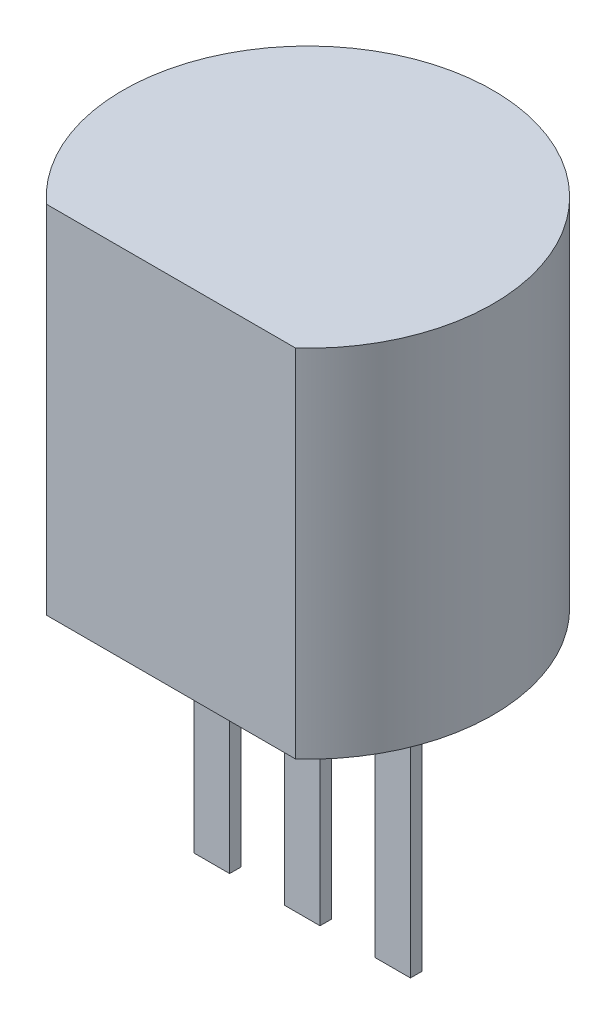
from build123d import *

# Parameters (mm, degrees)
EXTRUDE_START   = 1.5
EXTRUDE_1_DEPTH = 5
SKETCH_2_W      = 0.5
SKETCH_2_H      = 0.16
EXTRUDE_2_DEPTH = 3.7


with BuildPart() as part:
    # Sketch 1 → Extrude 1 (new body)
    with BuildSketch(Plane(origin=(0, 0, 0), x_dir=(1, 0, 0), z_dir=(0, 1, 0)).offset(EXTRUDE_START)):
        with BuildLine():
            Line((-1.75, -1.922888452), (1.75, -1.922888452))
            ThreePointArc((1.75, -1.922888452), (0, 2.6), (-1.75, -1.922888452))
        make_face()
    extrude(amount=EXTRUDE_1_DEPTH)

    # Sketch 2 → Extrude 2 (add)
    with BuildSketch(Plane.XZ.offset(-1.5)):
        Rectangle(SKETCH_2_W, SKETCH_2_H)
        with Locations((-1.27, 0)):
            Rectangle(SKETCH_2_W, SKETCH_2_H)
        with Locations((1.27, 0)):
            Rectangle(SKETCH_2_W, SKETCH_2_H)
    extrude(amount=EXTRUDE_2_DEPTH)


solid = part.part
